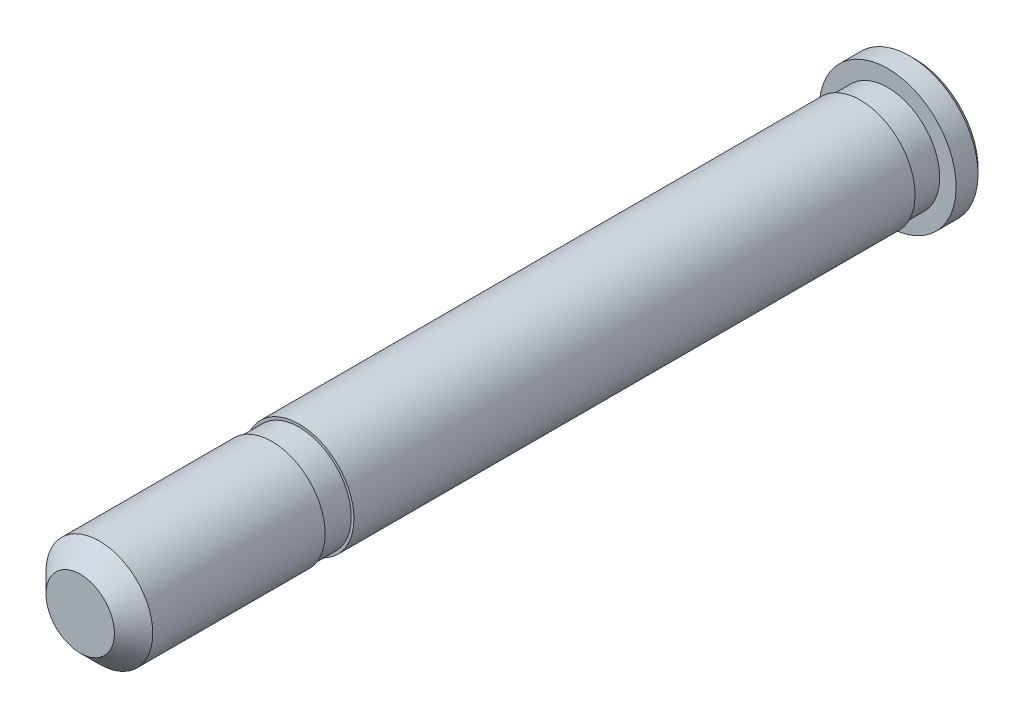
ISO-10303-21;
HEADER;
FILE_DESCRIPTION(('STEP AP214'),'2;1');
FILE_NAME('part.step','',(''),(''),'','','');
FILE_SCHEMA(('AUTOMOTIVE_DESIGN { 1 0 10303 214 1 1 1 1 }'));
ENDSEC;
DATA;
#1=APPLICATION_CONTEXT('core data for automotive mechanical design processes');
#2=APPLICATION_PROTOCOL_DEFINITION('international standard','automotive_design',2000,#1);
#3=PRODUCT_CONTEXT('',#1,'mechanical');
#4=PRODUCT('Part','Part','',(#3));
#5=PRODUCT_RELATED_PRODUCT_CATEGORY('part','',(#4));
#6=PRODUCT_DEFINITION_FORMATION('','',#4);
#7=PRODUCT_DEFINITION_CONTEXT('part definition',#1,'design');
#8=PRODUCT_DEFINITION('design','',#6,#7);
#9=PRODUCT_DEFINITION_SHAPE('','',#8);
#10=(LENGTH_UNIT() NAMED_UNIT(*) SI_UNIT(.MILLI.,.METRE.));
#11=(NAMED_UNIT(*) PLANE_ANGLE_UNIT() SI_UNIT($,.RADIAN.));
#12=(NAMED_UNIT(*) SI_UNIT($,.STERADIAN.) SOLID_ANGLE_UNIT());
#13=UNCERTAINTY_MEASURE_WITH_UNIT(LENGTH_MEASURE(1.E-05),#10,'distance_accuracy_value','');
#14=(GEOMETRIC_REPRESENTATION_CONTEXT(3) GLOBAL_UNCERTAINTY_ASSIGNED_CONTEXT((#13)) GLOBAL_UNIT_ASSIGNED_CONTEXT((#10,
#11,#12)) REPRESENTATION_CONTEXT('',''));
#15=CARTESIAN_POINT('',(0.,0.,0.));
#16=DIRECTION('',(0.,0.,1.));
#17=DIRECTION('',(1.,0.,0.));
#18=AXIS2_PLACEMENT_3D('',#15,#16,#17);
#19=CARTESIAN_POINT('',(0.,0.,0.));
#20=DIRECTION('',(0.,0.,-1.));
#21=DIRECTION('',(0.,1.,0.));
#22=AXIS2_PLACEMENT_3D('',#19,#20,#21);
#23=PLANE('',#22);
#24=CARTESIAN_POINT('',(0.,0.,0.));
#25=DIRECTION('',(0.,0.,-1.));
#26=DIRECTION('',(0.,1.,0.));
#27=AXIS2_PLACEMENT_3D('',#24,#25,#26);
#28=CIRCLE('',#27,2.3);
#29=CARTESIAN_POINT('',(0.,2.3,0.));
#30=VERTEX_POINT('',#29);
#31=EDGE_CURVE('E27',#30,#30,#28,.T.);
#32=ORIENTED_EDGE('',*,*,#31,.T.);
#33=EDGE_LOOP('',(#32));
#34=FACE_BOUND('',#33,.T.);
#35=ADVANCED_FACE('F12',(#34),#23,.T.);
#36=CARTESIAN_POINT('',(2.,0.,1.));
#37=DIRECTION('',(0.,0.,1.));
#38=DIRECTION('',(0.,-1.,0.));
#39=AXIS2_PLACEMENT_3D('',#36,#37,#38);
#40=PLANE('',#39);
#41=CARTESIAN_POINT('',(0.,0.,1.));
#42=DIRECTION('',(0.,0.,-1.));
#43=DIRECTION('',(0.,1.,0.));
#44=AXIS2_PLACEMENT_3D('',#41,#42,#43);
#45=CIRCLE('',#44,2.5);
#46=CARTESIAN_POINT('',(0.,2.5,1.));
#47=VERTEX_POINT('',#46);
#48=EDGE_CURVE('E37',#47,#47,#45,.T.);
#49=ORIENTED_EDGE('',*,*,#48,.F.);
#50=EDGE_LOOP('',(#49));
#51=FACE_BOUND('',#50,.T.);
#52=CARTESIAN_POINT('',(0.,0.,1.));
#53=DIRECTION('',(0.,0.,-1.));
#54=DIRECTION('',(0.,1.,0.));
#55=AXIS2_PLACEMENT_3D('',#52,#53,#54);
#56=CIRCLE('',#55,1.9);
#57=CARTESIAN_POINT('',(0.,1.9,1.));
#58=VERTEX_POINT('',#57);
#59=EDGE_CURVE('E32',#58,#58,#56,.T.);
#60=ORIENTED_EDGE('',*,*,#59,.T.);
#61=EDGE_LOOP('',(#60));
#62=FACE_BOUND('',#61,.T.);
#63=ADVANCED_FACE('F86',(#51,#62),#40,.T.);
#64=CARTESIAN_POINT('',(0.,0.,0.));
#65=DIRECTION('',(0.,0.,-1.));
#66=DIRECTION('',(0.,1.,0.));
#67=AXIS2_PLACEMENT_3D('',#64,#65,#66);
#68=CYLINDRICAL_SURFACE('',#67,2.5);
#69=CARTESIAN_POINT('',(0.,0.,0.200000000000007));
#70=DIRECTION('',(0.,0.,-1.));
#71=DIRECTION('',(0.,1.,0.));
#72=AXIS2_PLACEMENT_3D('',#69,#70,#71);
#73=CIRCLE('',#72,2.5);
#74=CARTESIAN_POINT('',(0.,2.5,0.200000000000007));
#75=VERTEX_POINT('',#74);
#76=EDGE_CURVE('E23',#75,#75,#73,.F.);
#77=ORIENTED_EDGE('',*,*,#76,.T.);
#78=EDGE_LOOP('',(#77));
#79=FACE_BOUND('',#78,.T.);
#80=ORIENTED_EDGE('',*,*,#48,.T.);
#81=EDGE_LOOP('',(#80));
#82=FACE_BOUND('',#81,.T.);
#83=ADVANCED_FACE('F93',(#79,#82),#68,.T.);
#84=CARTESIAN_POINT('',(0.,0.,0.));
#85=DIRECTION('',(0.,0.,1.));
#86=DIRECTION('',(0.,-1.,0.));
#87=AXIS2_PLACEMENT_3D('',#84,#85,#86);
#88=CONICAL_SURFACE('',#87,2.3,0.785398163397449);
#89=ORIENTED_EDGE('',*,*,#76,.F.);
#90=EDGE_LOOP('',(#89));
#91=FACE_BOUND('',#90,.T.);
#92=ORIENTED_EDGE('',*,*,#31,.F.);
#93=EDGE_LOOP('',(#92));
#94=FACE_BOUND('',#93,.T.);
#95=ADVANCED_FACE('F102',(#91,#94),#88,.T.);
#96=CARTESIAN_POINT('',(2.,0.,2.));
#97=DIRECTION('',(0.,0.,1.));
#98=DIRECTION('',(0.,-1.,0.));
#99=AXIS2_PLACEMENT_3D('',#96,#97,#98);
#100=PLANE('',#99);
#101=CARTESIAN_POINT('',(0.,0.,2.));
#102=DIRECTION('',(0.,0.,-1.));
#103=DIRECTION('',(0.,1.,0.));
#104=AXIS2_PLACEMENT_3D('',#101,#102,#103);
#105=CIRCLE('',#104,1.9);
#106=CARTESIAN_POINT('',(0.,1.9,2.));
#107=VERTEX_POINT('',#106);
#108=EDGE_CURVE('E43',#107,#107,#105,.T.);
#109=ORIENTED_EDGE('',*,*,#108,.F.);
#110=EDGE_LOOP('',(#109));
#111=FACE_BOUND('',#110,.T.);
#112=CARTESIAN_POINT('',(0.,0.,2.));
#113=DIRECTION('',(0.,0.,-1.));
#114=DIRECTION('',(0.,1.,0.));
#115=AXIS2_PLACEMENT_3D('',#112,#113,#114);
#116=CIRCLE('',#115,2.);
#117=CARTESIAN_POINT('',(0.,2.,2.));
#118=VERTEX_POINT('',#117);
#119=EDGE_CURVE('E40',#118,#118,#116,.T.);
#120=ORIENTED_EDGE('',*,*,#119,.T.);
#121=EDGE_LOOP('',(#120));
#122=FACE_BOUND('',#121,.T.);
#123=ADVANCED_FACE('F104',(#111,#122),#100,.F.);
#124=CARTESIAN_POINT('',(0.,0.,0.));
#125=DIRECTION('',(0.,0.,-1.));
#126=DIRECTION('',(0.,1.,0.));
#127=AXIS2_PLACEMENT_3D('',#124,#125,#126);
#128=CYLINDRICAL_SURFACE('',#127,1.9);
#129=ORIENTED_EDGE('',*,*,#59,.F.);
#130=EDGE_LOOP('',(#129));
#131=FACE_BOUND('',#130,.T.);
#132=ORIENTED_EDGE('',*,*,#108,.T.);
#133=EDGE_LOOP('',(#132));
#134=FACE_BOUND('',#133,.T.);
#135=ADVANCED_FACE('F100',(#131,#134),#128,.T.);
#136=CARTESIAN_POINT('',(0.,0.,0.));
#137=DIRECTION('',(0.,0.,-1.));
#138=DIRECTION('',(0.,1.,0.));
#139=AXIS2_PLACEMENT_3D('',#136,#137,#138);
#140=CYLINDRICAL_SURFACE('',#139,2.);
#141=CARTESIAN_POINT('',(0.,0.,22.5));
#142=DIRECTION('',(0.,0.,-1.));
#143=DIRECTION('',(0.,1.,0.));
#144=AXIS2_PLACEMENT_3D('',#141,#142,#143);
#145=CIRCLE('',#144,2.);
#146=CARTESIAN_POINT('',(0.,2.,22.5));
#147=VERTEX_POINT('',#146);
#148=EDGE_CURVE('E30',#147,#147,#145,.F.);
#149=ORIENTED_EDGE('',*,*,#148,.F.);
#150=EDGE_LOOP('',(#149));
#151=FACE_BOUND('',#150,.T.);
#152=ORIENTED_EDGE('',*,*,#119,.F.);
#153=EDGE_LOOP('',(#152));
#154=FACE_BOUND('',#153,.T.);
#155=ADVANCED_FACE('F98',(#151,#154),#140,.T.);
#156=CARTESIAN_POINT('',(1.95,0.,22.5));
#157=DIRECTION('',(0.,0.,-1.));
#158=DIRECTION('',(0.,1.,0.));
#159=AXIS2_PLACEMENT_3D('',#156,#157,#158);
#160=PLANE('',#159);
#161=ORIENTED_EDGE('',*,*,#148,.T.);
#162=EDGE_LOOP('',(#161));
#163=FACE_BOUND('',#162,.T.);
#164=CARTESIAN_POINT('',(0.,0.,22.5));
#165=DIRECTION('',(0.,0.,-1.));
#166=DIRECTION('',(0.,1.,0.));
#167=AXIS2_PLACEMENT_3D('',#164,#165,#166);
#168=CIRCLE('',#167,1.9);
#169=CARTESIAN_POINT('',(0.,1.9,22.5));
#170=VERTEX_POINT('',#169);
#171=EDGE_CURVE('E53',#170,#170,#168,.T.);
#172=ORIENTED_EDGE('',*,*,#171,.T.);
#173=EDGE_LOOP('',(#172));
#174=FACE_BOUND('',#173,.T.);
#175=ADVANCED_FACE('F57',(#163,#174),#160,.F.);
#176=CARTESIAN_POINT('',(1.95,0.,23.5));
#177=DIRECTION('',(0.,0.,1.));
#178=DIRECTION('',(0.,-1.,0.));
#179=AXIS2_PLACEMENT_3D('',#176,#177,#178);
#180=PLANE('',#179);
#181=CARTESIAN_POINT('',(0.,0.,23.5));
#182=DIRECTION('',(0.,0.,-1.));
#183=DIRECTION('',(0.,1.,0.));
#184=AXIS2_PLACEMENT_3D('',#181,#182,#183);
#185=CIRCLE('',#184,1.9);
#186=CARTESIAN_POINT('',(0.,1.9,23.5));
#187=VERTEX_POINT('',#186);
#188=EDGE_CURVE('E50',#187,#187,#185,.T.);
#189=ORIENTED_EDGE('',*,*,#188,.F.);
#190=EDGE_LOOP('',(#189));
#191=FACE_BOUND('',#190,.T.);
#192=CARTESIAN_POINT('',(0.,0.,23.5));
#193=DIRECTION('',(0.,0.,-1.));
#194=DIRECTION('',(0.,1.,0.));
#195=AXIS2_PLACEMENT_3D('',#192,#193,#194);
#196=CIRCLE('',#195,1.95);
#197=CARTESIAN_POINT('',(0.,1.95,23.5));
#198=VERTEX_POINT('',#197);
#199=EDGE_CURVE('E33',#198,#198,#196,.T.);
#200=ORIENTED_EDGE('',*,*,#199,.T.);
#201=EDGE_LOOP('',(#200));
#202=FACE_BOUND('',#201,.T.);
#203=ADVANCED_FACE('F63',(#191,#202),#180,.F.);
#204=CARTESIAN_POINT('',(0.,0.,0.));
#205=DIRECTION('',(0.,0.,-1.));
#206=DIRECTION('',(0.,1.,0.));
#207=AXIS2_PLACEMENT_3D('',#204,#205,#206);
#208=CYLINDRICAL_SURFACE('',#207,1.9);
#209=ORIENTED_EDGE('',*,*,#171,.F.);
#210=EDGE_LOOP('',(#209));
#211=FACE_BOUND('',#210,.T.);
#212=ORIENTED_EDGE('',*,*,#188,.T.);
#213=EDGE_LOOP('',(#212));
#214=FACE_BOUND('',#213,.T.);
#215=ADVANCED_FACE('F59',(#211,#214),#208,.T.);
#216=CARTESIAN_POINT('',(0.,0.,30.5));
#217=DIRECTION('',(0.,0.,1.));
#218=DIRECTION('',(0.,-1.,0.));
#219=AXIS2_PLACEMENT_3D('',#216,#217,#218);
#220=PLANE('',#219);
#221=CARTESIAN_POINT('',(0.,0.,30.5));
#222=DIRECTION('',(0.,0.,1.));
#223=DIRECTION('',(0.,-1.,0.));
#224=AXIS2_PLACEMENT_3D('',#221,#222,#223);
#225=CIRCLE('',#224,1.25);
#226=CARTESIAN_POINT('',(0.,-1.25,30.5));
#227=VERTEX_POINT('',#226);
#228=EDGE_CURVE('E8',#227,#227,#225,.T.);
#229=ORIENTED_EDGE('',*,*,#228,.T.);
#230=EDGE_LOOP('',(#229));
#231=FACE_BOUND('',#230,.T.);
#232=ADVANCED_FACE('F62',(#231),#220,.T.);
#233=CARTESIAN_POINT('',(0.,0.,0.));
#234=DIRECTION('',(0.,0.,-1.));
#235=DIRECTION('',(0.,1.,0.));
#236=AXIS2_PLACEMENT_3D('',#233,#234,#235);
#237=CYLINDRICAL_SURFACE('',#236,1.95);
#238=CARTESIAN_POINT('',(0.,0.,29.8));
#239=DIRECTION('',(0.,0.,1.));
#240=DIRECTION('',(0.,-1.,0.));
#241=AXIS2_PLACEMENT_3D('',#238,#239,#240);
#242=CIRCLE('',#241,1.95);
#243=CARTESIAN_POINT('',(0.,-1.95,29.8));
#244=VERTEX_POINT('',#243);
#245=EDGE_CURVE('E19',#244,#244,#242,.F.);
#246=ORIENTED_EDGE('',*,*,#245,.T.);
#247=EDGE_LOOP('',(#246));
#248=FACE_BOUND('',#247,.T.);
#249=ORIENTED_EDGE('',*,*,#199,.F.);
#250=EDGE_LOOP('',(#249));
#251=FACE_BOUND('',#250,.T.);
#252=ADVANCED_FACE('F72',(#248,#251),#237,.T.);
#253=CARTESIAN_POINT('',(0.,0.,29.8));
#254=DIRECTION('',(0.,0.,-1.));
#255=DIRECTION('',(0.,1.,0.));
#256=AXIS2_PLACEMENT_3D('',#253,#254,#255);
#257=CONICAL_SURFACE('',#256,1.95,0.78539816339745);
#258=ORIENTED_EDGE('',*,*,#228,.F.);
#259=EDGE_LOOP('',(#258));
#260=FACE_BOUND('',#259,.T.);
#261=ORIENTED_EDGE('',*,*,#245,.F.);
#262=EDGE_LOOP('',(#261));
#263=FACE_BOUND('',#262,.T.);
#264=ADVANCED_FACE('F14',(#260,#263),#257,.T.);
#265=CLOSED_SHELL('',(#35,#63,#83,#95,#123,#135,#155,#175,#203,#215,#232,#252,#264));
#266=MANIFOLD_SOLID_BREP('B1',#265);
#267=ADVANCED_BREP_SHAPE_REPRESENTATION('',(#18,#266),#14);
#268=SHAPE_DEFINITION_REPRESENTATION(#9,#267);
ENDSEC;
END-ISO-10303-21;
